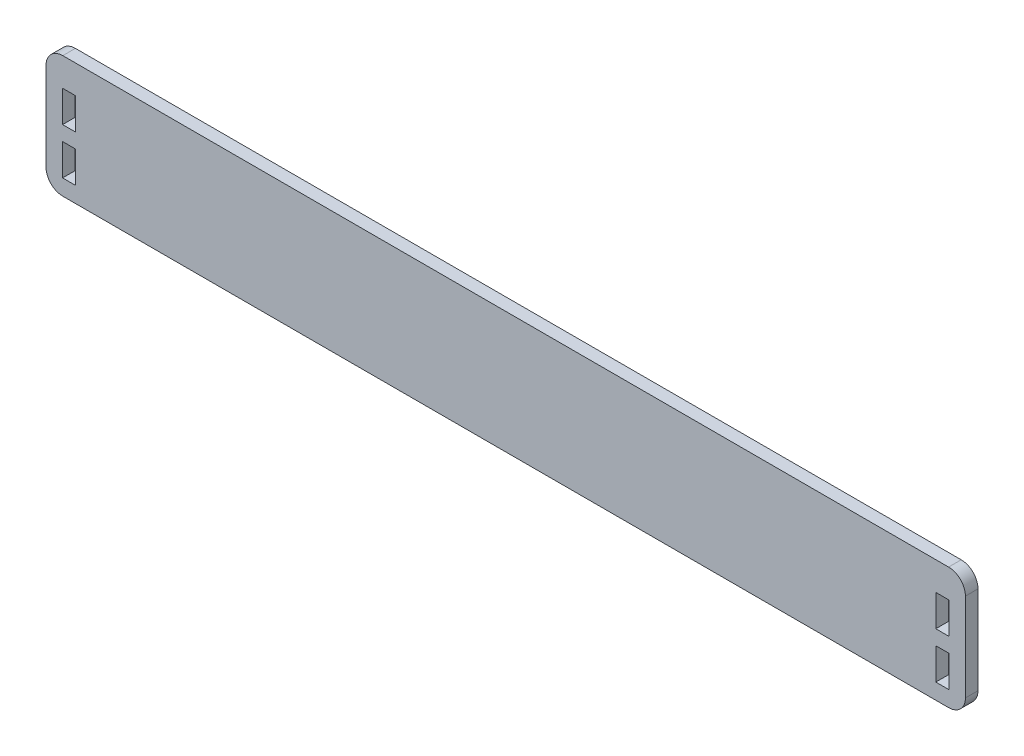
from build123d import *

# Parameters (mm, degrees)
SKETCH1_W                       = 438
SKETCH1_H                       = 58
BOSS_EXTRUDE1_DEPTH             = 6
SKETCH2_W                       = 6.2
SKETCH2_H                       = 15
HOLES_FOR_SIDE_PANEL_TABS_DEPTH = 430.147993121
FILLET1_R                       = 8


with BuildPart() as part:
    # Sketch1 → Boss-Extrude1 (new body)
    with BuildSketch(Plane.XY):
        with Locations((205, 37)):
            Rectangle(SKETCH1_W, SKETCH1_H)
    extrude(amount=BOSS_EXTRUDE1_DEPTH)

    # Sketch2 → holes for side panel tabs (cut, through all)
    with BuildSketch(Plane.XY.offset(6)):
        with Locations((-3, 45)):
            Rectangle(SKETCH2_W, SKETCH2_H)
        with Locations((-3, 23)):
            Rectangle(SKETCH2_W, SKETCH2_H)
        with Locations((413, 45)):
            Rectangle(SKETCH2_W, SKETCH2_H)
        with Locations((413, 23)):
            Rectangle(SKETCH2_W, SKETCH2_H)
    extrude(amount=-HOLES_FOR_SIDE_PANEL_TABS_DEPTH, mode=Mode.SUBTRACT)

    # Fillet1
    fillet1_edges = [part.edges().sort_by_distance(p)[0] for p in [
        (-14, 66, 3),
        (424, 66, 3),
        (424, 8, 3),
        (-14, 8, 3),
    ]]
    fillet(fillet1_edges, radius=FILLET1_R)


solid = part.part
